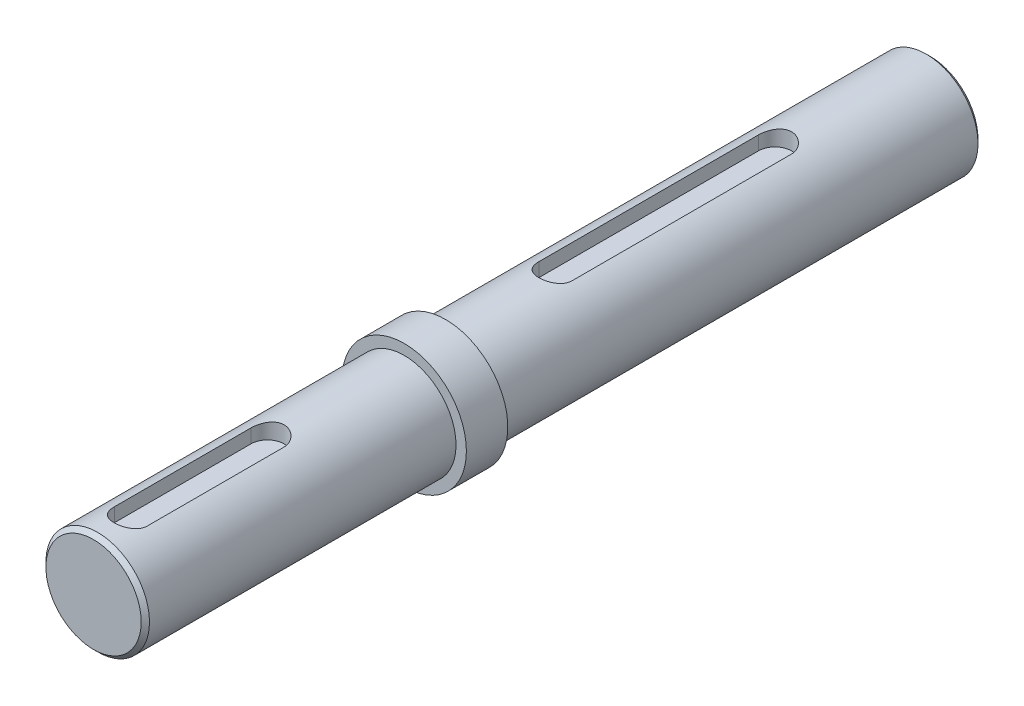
ISO-10303-21;
HEADER;
FILE_DESCRIPTION(('STEP AP214'),'2;1');
FILE_NAME('part.step','',(''),(''),'','','');
FILE_SCHEMA(('AUTOMOTIVE_DESIGN { 1 0 10303 214 1 1 1 1 }'));
ENDSEC;
DATA;
#1=APPLICATION_CONTEXT('core data for automotive mechanical design processes');
#2=APPLICATION_PROTOCOL_DEFINITION('international standard','automotive_design',2000,#1);
#3=PRODUCT_CONTEXT('',#1,'mechanical');
#4=PRODUCT('Part','Part','',(#3));
#5=PRODUCT_RELATED_PRODUCT_CATEGORY('part','',(#4));
#6=PRODUCT_DEFINITION_FORMATION('','',#4);
#7=PRODUCT_DEFINITION_CONTEXT('part definition',#1,'design');
#8=PRODUCT_DEFINITION('design','',#6,#7);
#9=PRODUCT_DEFINITION_SHAPE('','',#8);
#10=(LENGTH_UNIT() NAMED_UNIT(*) SI_UNIT(.MILLI.,.METRE.));
#11=(NAMED_UNIT(*) PLANE_ANGLE_UNIT() SI_UNIT($,.RADIAN.));
#12=(NAMED_UNIT(*) SI_UNIT($,.STERADIAN.) SOLID_ANGLE_UNIT());
#13=UNCERTAINTY_MEASURE_WITH_UNIT(LENGTH_MEASURE(1.E-05),#10,'distance_accuracy_value','');
#14=(GEOMETRIC_REPRESENTATION_CONTEXT(3) GLOBAL_UNCERTAINTY_ASSIGNED_CONTEXT((#13)) GLOBAL_UNIT_ASSIGNED_CONTEXT((#10,
#11,#12)) REPRESENTATION_CONTEXT('',''));
#15=CARTESIAN_POINT('',(0.,0.,0.));
#16=DIRECTION('',(0.,0.,1.));
#17=DIRECTION('',(1.,0.,0.));
#18=AXIS2_PLACEMENT_3D('',#15,#16,#17);
#19=CARTESIAN_POINT('',(0.,0.,202.));
#20=DIRECTION('',(0.,0.,-1.));
#21=DIRECTION('',(-1.,0.,0.));
#22=AXIS2_PLACEMENT_3D('',#19,#20,#21);
#23=CYLINDRICAL_SURFACE('',#22,15.);
#24=CARTESIAN_POINT('',(0.,0.,127.));
#25=DIRECTION('',(0.,0.,1.));
#26=DIRECTION('',(1.,0.,0.));
#27=AXIS2_PLACEMENT_3D('',#24,#25,#26);
#28=CIRCLE('',#27,15.);
#29=CARTESIAN_POINT('',(15.,0.,127.));
#30=VERTEX_POINT('',#29);
#31=EDGE_CURVE('E199',#30,#30,#28,.T.);
#32=ORIENTED_EDGE('',*,*,#31,.F.);
#33=EDGE_LOOP('',(#32));
#34=FACE_BOUND('',#33,.T.);
#35=CARTESIAN_POINT('',(0.,0.,117.));
#36=DIRECTION('',(0.,0.,-1.));
#37=DIRECTION('',(-1.,0.,0.));
#38=AXIS2_PLACEMENT_3D('',#35,#36,#37);
#39=CIRCLE('',#38,15.);
#40=CARTESIAN_POINT('',(-15.,0.,117.));
#41=VERTEX_POINT('',#40);
#42=EDGE_CURVE('E194',#41,#41,#39,.T.);
#43=ORIENTED_EDGE('',*,*,#42,.F.);
#44=EDGE_LOOP('',(#43));
#45=FACE_BOUND('',#44,.T.);
#46=ADVANCED_FACE('F44',(#34,#45),#23,.T.);
#47=CARTESIAN_POINT('',(0.,0.,127.));
#48=DIRECTION('',(0.,0.,1.));
#49=DIRECTION('',(1.,0.,0.));
#50=AXIS2_PLACEMENT_3D('',#47,#48,#49);
#51=PLANE('',#50);
#52=CARTESIAN_POINT('',(0.,0.,127.));
#53=DIRECTION('',(0.,0.,1.));
#54=DIRECTION('',(1.,0.,0.));
#55=AXIS2_PLACEMENT_3D('',#52,#53,#54);
#56=CIRCLE('',#55,12.5);
#57=CARTESIAN_POINT('',(12.5,0.,127.));
#58=VERTEX_POINT('',#57);
#59=EDGE_CURVE('E195',#58,#58,#56,.T.);
#60=ORIENTED_EDGE('',*,*,#59,.F.);
#61=EDGE_LOOP('',(#60));
#62=FACE_BOUND('',#61,.T.);
#63=ORIENTED_EDGE('',*,*,#31,.T.);
#64=EDGE_LOOP('',(#63));
#65=FACE_BOUND('',#64,.T.);
#66=ADVANCED_FACE('F308',(#62,#65),#51,.T.);
#67=CARTESIAN_POINT('',(0.,0.,127.));
#68=DIRECTION('',(0.,0.,1.));
#69=DIRECTION('',(1.,0.,0.));
#70=AXIS2_PLACEMENT_3D('',#67,#68,#69);
#71=CYLINDRICAL_SURFACE('',#70,12.5);
#72=CARTESIAN_POINT('',(0.,0.,201.));
#73=DIRECTION('',(0.,0.,1.));
#74=DIRECTION('',(1.,0.,0.));
#75=AXIS2_PLACEMENT_3D('',#72,#73,#74);
#76=CIRCLE('',#75,12.5);
#77=CARTESIAN_POINT('',(12.5,0.,201.));
#78=VERTEX_POINT('',#77);
#79=EDGE_CURVE('E12',#78,#78,#76,.F.);
#80=ORIENTED_EDGE('',*,*,#79,.T.);
#81=EDGE_LOOP('',(#80));
#82=FACE_BOUND('',#81,.T.);
#83=CARTESIAN_POINT('',(4.,11.842719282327,160.));
#84=CARTESIAN_POINT('',(4.00001410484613,11.8427027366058,159.890600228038));
#85=CARTESIAN_POINT('',(3.995512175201,11.8442348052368,159.781209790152));
#86=CARTESIAN_POINT('',(3.97758606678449,11.8502730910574,159.563271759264));
#87=CARTESIAN_POINT('',(3.96416412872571,11.8547785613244,159.454723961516));
#88=CARTESIAN_POINT('',(3.9285572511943,11.8666242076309,159.239538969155));
#89=CARTESIAN_POINT('',(3.9063967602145,11.8739564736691,159.132897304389));
#90=CARTESIAN_POINT('',(3.85353581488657,11.8912164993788,158.921994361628));
#91=CARTESIAN_POINT('',(3.82283508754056,11.90114434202,158.817733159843));
#92=CARTESIAN_POINT('',(3.71831764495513,11.9343840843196,158.509694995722));
#93=CARTESIAN_POINT('',(3.63203544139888,11.9611699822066,158.310363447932));
#94=CARTESIAN_POINT('',(3.42895021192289,12.0209583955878,157.928987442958));
#95=CARTESIAN_POINT('',(3.31213030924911,12.0539643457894,157.74695262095));
#96=CARTESIAN_POINT('',(3.04678507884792,12.123798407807,157.398746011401));
#97=CARTESIAN_POINT('',(2.89735303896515,12.1607158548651,157.233281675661));
#98=CARTESIAN_POINT('',(2.57296449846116,12.2334561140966,156.929285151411));
#99=CARTESIAN_POINT('',(2.39800356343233,12.2692787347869,156.790757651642));
#100=CARTESIAN_POINT('',(2.02237003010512,12.3368244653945,156.541384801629));
#101=CARTESIAN_POINT('',(1.82118394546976,12.3684294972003,156.43127804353));
#102=CARTESIAN_POINT('',(1.40197197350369,12.4229251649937,156.246750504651));
#103=CARTESIAN_POINT('',(1.18395091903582,12.4458182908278,156.172319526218));
#104=CARTESIAN_POINT('',(0.744713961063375,12.4796767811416,156.063641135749));
#105=CARTESIAN_POINT('',(0.523827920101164,12.4910030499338,156.02817506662));
#106=CARTESIAN_POINT('',(0.0789648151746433,12.5017287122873,155.994567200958));
#107=CARTESIAN_POINT('',(-0.145011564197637,12.5011307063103,155.996417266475));
#108=CARTESIAN_POINT('',(-0.581094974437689,12.4883236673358,156.036598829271));
#109=CARTESIAN_POINT('',(-0.793338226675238,12.4765355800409,156.073607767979));
#110=CARTESIAN_POINT('',(-1.2084232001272,12.443194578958,156.180880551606));
#111=CARTESIAN_POINT('',(-1.41126440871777,12.4216411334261,156.251146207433));
#112=CARTESIAN_POINT('',(-1.80478548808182,12.3706364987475,156.423757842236));
#113=CARTESIAN_POINT('',(-1.99528012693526,12.3410893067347,156.526496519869));
#114=CARTESIAN_POINT('',(-2.35673113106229,12.2771965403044,156.760829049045));
#115=CARTESIAN_POINT('',(-2.5276825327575,12.2428497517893,156.892430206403));
#116=CARTESIAN_POINT('',(-2.8530451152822,12.1712409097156,157.187446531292));
#117=CARTESIAN_POINT('',(-3.00641313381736,12.1339170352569,157.351996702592));
#118=CARTESIAN_POINT('',(-3.283772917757,12.0618172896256,157.704971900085));
#119=CARTESIAN_POINT('',(-3.40775562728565,12.0270422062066,157.893404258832));
#120=CARTESIAN_POINT('',(-3.56958208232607,11.9796198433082,158.191371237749));
#121=CARTESIAN_POINT('',(-3.61975674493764,11.9645161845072,158.293999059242));
#122=CARTESIAN_POINT('',(-3.71123075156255,11.9364591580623,158.503404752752));
#123=CARTESIAN_POINT('',(-3.75253376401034,11.9235049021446,158.610180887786));
#124=CARTESIAN_POINT('',(-3.82585831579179,11.9001802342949,158.827013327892));
#125=CARTESIAN_POINT('',(-3.85788979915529,11.889807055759,158.937065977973));
#126=CARTESIAN_POINT('',(-3.91241790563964,11.8719756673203,159.159695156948));
#127=CARTESIAN_POINT('',(-3.93491889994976,11.8645161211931,159.272270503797));
#128=CARTESIAN_POINT('',(-3.96832908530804,11.8533815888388,159.487239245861));
#129=CARTESIAN_POINT('',(-3.9802038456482,11.8493925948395,159.589467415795));
#130=CARTESIAN_POINT('',(-3.99603937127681,11.8440568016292,159.794461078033));
#131=CARTESIAN_POINT('',(-4.00001099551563,11.8427063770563,159.897225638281));
#132=CARTESIAN_POINT('',(-4.,11.842719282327,160.));
#133=B_SPLINE_CURVE_WITH_KNOTS('',3,(#83,#84,#85,#86,#87,#88,#89,#90,#91,#92,#93,#94,#95,#96,
#97,#98,#99,#100,#101,#102,#103,#104,#105,#106,#107,#108,#109,#110,#111,#112,#113,#114,#115,
#116,#117,#118,#119,#120,#121,#122,#123,#124,#125,#126,#127,#128,#129,#130,#131,#132),
.UNSPECIFIED.,.F.,.F.,(4,2,2,2,2,2,2,2,2,2,2,2,2,2,2,2,2,2,2,2,2,2,2,2,4),(0.,0.328080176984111,
0.656077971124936,0.983164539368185,1.31026156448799,1.96355293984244,2.61720612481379,
3.29209427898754,3.96709980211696,4.65819584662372,5.34909422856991,6.01770820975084,
6.68617638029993,7.33045501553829,7.97476873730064,8.62719320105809,9.27978300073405,
9.96076419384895,10.6419549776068,10.9872862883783,11.3324745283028,11.6772911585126,
12.0219494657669,12.3305938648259,12.6388138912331),.UNSPECIFIED.);
#134=CARTESIAN_POINT('',(4.,11.842719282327,160.));
#135=VERTEX_POINT('',#134);
#136=CARTESIAN_POINT('',(-4.,11.842719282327,160.));
#137=VERTEX_POINT('',#136);
#138=EDGE_CURVE('E202',#135,#137,#133,.T.);
#139=ORIENTED_EDGE('',*,*,#138,.F.);
#140=DIRECTION('',(0.,0.,1.));
#141=VECTOR('',#140,1.);
#142=CARTESIAN_POINT('',(4.,11.842719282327,127.));
#143=LINE('',#142,#141);
#144=CARTESIAN_POINT('',(4.,11.842719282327,193.));
#145=VERTEX_POINT('',#144);
#146=EDGE_CURVE('E245',#145,#135,#143,.F.);
#147=ORIENTED_EDGE('',*,*,#146,.F.);
#148=CARTESIAN_POINT('',(-4.,11.842719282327,193.));
#149=CARTESIAN_POINT('',(-4.00001410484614,11.8427027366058,193.109399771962));
#150=CARTESIAN_POINT('',(-3.995512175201,11.8442348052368,193.218790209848));
#151=CARTESIAN_POINT('',(-3.97758606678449,11.8502730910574,193.436728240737));
#152=CARTESIAN_POINT('',(-3.96416412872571,11.8547785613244,193.545276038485));
#153=CARTESIAN_POINT('',(-3.92855725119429,11.8666242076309,193.760461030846));
#154=CARTESIAN_POINT('',(-3.90639676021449,11.8739564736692,193.867102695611));
#155=CARTESIAN_POINT('',(-3.85353581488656,11.8912164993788,194.078005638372));
#156=CARTESIAN_POINT('',(-3.82283508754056,11.90114434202,194.182266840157));
#157=CARTESIAN_POINT('',(-3.71831764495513,11.9343840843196,194.490305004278));
#158=CARTESIAN_POINT('',(-3.63203544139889,11.9611699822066,194.689636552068));
#159=CARTESIAN_POINT('',(-3.42895021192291,12.0209583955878,195.071012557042));
#160=CARTESIAN_POINT('',(-3.31213030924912,12.0539643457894,195.25304737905));
#161=CARTESIAN_POINT('',(-3.04678507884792,12.123798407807,195.601253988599));
#162=CARTESIAN_POINT('',(-2.89735303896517,12.1607158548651,195.766718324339));
#163=CARTESIAN_POINT('',(-2.57296449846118,12.2334561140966,196.070714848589));
#164=CARTESIAN_POINT('',(-2.39800356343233,12.2692787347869,196.209242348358));
#165=CARTESIAN_POINT('',(-2.02237003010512,12.3368244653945,196.458615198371));
#166=CARTESIAN_POINT('',(-1.82118394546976,12.3684294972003,196.56872195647));
#167=CARTESIAN_POINT('',(-1.40197197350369,12.4229251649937,196.753249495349));
#168=CARTESIAN_POINT('',(-1.18395091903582,12.4458182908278,196.827680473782));
#169=CARTESIAN_POINT('',(-0.744713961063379,12.4796767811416,196.936358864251));
#170=CARTESIAN_POINT('',(-0.523827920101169,12.4910030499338,196.97182493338));
#171=CARTESIAN_POINT('',(-0.0789648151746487,12.5017287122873,197.005432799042));
#172=CARTESIAN_POINT('',(0.145011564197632,12.5011307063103,197.003582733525));
#173=CARTESIAN_POINT('',(0.581094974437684,12.4883236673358,196.963401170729));
#174=CARTESIAN_POINT('',(0.793338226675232,12.4765355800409,196.926392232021));
#175=CARTESIAN_POINT('',(1.2084232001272,12.443194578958,196.819119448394));
#176=CARTESIAN_POINT('',(1.41126440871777,12.4216411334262,196.748853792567));
#177=CARTESIAN_POINT('',(1.80478548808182,12.3706364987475,196.576242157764));
#178=CARTESIAN_POINT('',(1.99528012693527,12.3410893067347,196.473503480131));
#179=CARTESIAN_POINT('',(2.35673113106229,12.2771965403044,196.239170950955));
#180=CARTESIAN_POINT('',(2.5276825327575,12.2428497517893,196.107569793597));
#181=CARTESIAN_POINT('',(2.8530451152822,12.1712409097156,195.812553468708));
#182=CARTESIAN_POINT('',(3.00641313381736,12.1339170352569,195.648003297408));
#183=CARTESIAN_POINT('',(3.283772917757,12.0618172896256,195.295028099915));
#184=CARTESIAN_POINT('',(3.40775562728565,12.0270422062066,195.106595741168));
#185=CARTESIAN_POINT('',(3.56958208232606,11.9796198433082,194.808628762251));
#186=CARTESIAN_POINT('',(3.61975674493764,11.9645161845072,194.706000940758));
#187=CARTESIAN_POINT('',(3.71123075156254,11.9364591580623,194.496595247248));
#188=CARTESIAN_POINT('',(3.75253376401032,11.9235049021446,194.389819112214));
#189=CARTESIAN_POINT('',(3.82585831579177,11.9001802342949,194.172986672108));
#190=CARTESIAN_POINT('',(3.85788979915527,11.889807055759,194.062934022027));
#191=CARTESIAN_POINT('',(3.91241790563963,11.8719756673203,193.840304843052));
#192=CARTESIAN_POINT('',(3.93491889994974,11.8645161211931,193.727729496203));
#193=CARTESIAN_POINT('',(3.96832908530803,11.8533815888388,193.512760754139));
#194=CARTESIAN_POINT('',(3.98020384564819,11.8493925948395,193.410532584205));
#195=CARTESIAN_POINT('',(3.9960393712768,11.8440568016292,193.205538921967));
#196=CARTESIAN_POINT('',(4.00001099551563,11.8427063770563,193.102774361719));
#197=CARTESIAN_POINT('',(4.,11.842719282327,193.));
#198=B_SPLINE_CURVE_WITH_KNOTS('',3,(#148,#149,#150,#151,#152,#153,#154,#155,#156,#157,#158,
#159,#160,#161,#162,#163,#164,#165,#166,#167,#168,#169,#170,#171,#172,#173,#174,#175,#176,#177,
#178,#179,#180,#181,#182,#183,#184,#185,#186,#187,#188,#189,#190,#191,#192,#193,#194,#195,#196,
#197),.UNSPECIFIED.,.F.,.F.,(4,2,2,2,2,2,2,2,2,2,2,2,2,2,2,2,2,2,2,2,2,2,2,2,4),(0.,
0.328080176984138,0.656077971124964,0.98316453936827,1.31026156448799,1.96355293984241,
2.61720612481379,3.29209427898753,3.96709980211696,4.65819584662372,5.34909422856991,
6.01770820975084,6.68617638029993,7.33045501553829,7.97476873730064,8.62719320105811,
9.27978300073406,9.96076419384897,10.6419549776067,10.9872862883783,11.3324745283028,
11.6772911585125,12.0219494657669,12.3305938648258,12.6388138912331),.UNSPECIFIED.);
#199=CARTESIAN_POINT('',(-4.,11.842719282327,193.));
#200=VERTEX_POINT('',#199);
#201=EDGE_CURVE('E239',#200,#145,#198,.T.);
#202=ORIENTED_EDGE('',*,*,#201,.F.);
#203=DIRECTION('',(0.,0.,1.));
#204=VECTOR('',#203,1.);
#205=CARTESIAN_POINT('',(-4.,11.842719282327,127.));
#206=LINE('',#205,#204);
#207=EDGE_CURVE('E213',#137,#200,#206,.T.);
#208=ORIENTED_EDGE('',*,*,#207,.F.);
#209=EDGE_LOOP('',(#139,#147,#202,#208));
#210=FACE_BOUND('',#209,.T.);
#211=ORIENTED_EDGE('',*,*,#59,.T.);
#212=EDGE_LOOP('',(#211));
#213=FACE_BOUND('',#212,.T.);
#214=ADVANCED_FACE('F215',(#82,#210,#213),#71,.T.);
#215=CARTESIAN_POINT('',(0.,0.,202.));
#216=DIRECTION('',(0.,0.,1.));
#217=DIRECTION('',(1.,0.,0.));
#218=AXIS2_PLACEMENT_3D('',#215,#216,#217);
#219=PLANE('',#218);
#220=CARTESIAN_POINT('',(0.,0.,202.));
#221=DIRECTION('',(0.,0.,1.));
#222=DIRECTION('',(1.,0.,0.));
#223=AXIS2_PLACEMENT_3D('',#220,#221,#222);
#224=CIRCLE('',#223,11.5);
#225=CARTESIAN_POINT('',(11.5,0.,202.));
#226=VERTEX_POINT('',#225);
#227=EDGE_CURVE('E52',#226,#226,#224,.T.);
#228=ORIENTED_EDGE('',*,*,#227,.T.);
#229=EDGE_LOOP('',(#228));
#230=FACE_BOUND('',#229,.T.);
#231=ADVANCED_FACE('F292',(#230),#219,.T.);
#232=CARTESIAN_POINT('',(0.,0.,117.));
#233=DIRECTION('',(0.,0.,-1.));
#234=DIRECTION('',(-1.,0.,0.));
#235=AXIS2_PLACEMENT_3D('',#232,#233,#234);
#236=PLANE('',#235);
#237=CARTESIAN_POINT('',(0.,0.,117.));
#238=DIRECTION('',(0.,0.,-1.));
#239=DIRECTION('',(-1.,0.,0.));
#240=AXIS2_PLACEMENT_3D('',#237,#238,#239);
#241=CIRCLE('',#240,12.5);
#242=CARTESIAN_POINT('',(-12.5,0.,117.));
#243=VERTEX_POINT('',#242);
#244=EDGE_CURVE('E180',#243,#243,#241,.T.);
#245=ORIENTED_EDGE('',*,*,#244,.F.);
#246=EDGE_LOOP('',(#245));
#247=FACE_BOUND('',#246,.T.);
#248=ORIENTED_EDGE('',*,*,#42,.T.);
#249=EDGE_LOOP('',(#248));
#250=FACE_BOUND('',#249,.T.);
#251=ADVANCED_FACE('F318',(#247,#250),#236,.T.);
#252=CARTESIAN_POINT('',(0.,0.,117.));
#253=DIRECTION('',(0.,0.,-1.));
#254=DIRECTION('',(-1.,0.,0.));
#255=AXIS2_PLACEMENT_3D('',#252,#253,#254);
#256=CYLINDRICAL_SURFACE('',#255,12.5);
#257=CARTESIAN_POINT('',(0.,0.,1.));
#258=DIRECTION('',(0.,0.,1.));
#259=DIRECTION('',(1.,0.,0.));
#260=AXIS2_PLACEMENT_3D('',#257,#258,#259);
#261=CIRCLE('',#260,12.5);
#262=CARTESIAN_POINT('',(12.5,0.,1.));
#263=VERTEX_POINT('',#262);
#264=EDGE_CURVE('E285',#263,#263,#261,.T.);
#265=ORIENTED_EDGE('',*,*,#264,.T.);
#266=EDGE_LOOP('',(#265));
#267=FACE_BOUND('',#266,.T.);
#268=CARTESIAN_POINT('',(-3.99999999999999,11.842719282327,90.5));
#269=CARTESIAN_POINT('',(-4.00001410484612,11.8427027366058,90.6093997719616));
#270=CARTESIAN_POINT('',(-3.99551217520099,11.8442348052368,90.7187902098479));
#271=CARTESIAN_POINT('',(-3.97758606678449,11.8502730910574,90.9367282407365));
#272=CARTESIAN_POINT('',(-3.9641641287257,11.8547785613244,91.0452760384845));
#273=CARTESIAN_POINT('',(-3.92855725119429,11.8666242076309,91.2604610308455));
#274=CARTESIAN_POINT('',(-3.90639676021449,11.8739564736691,91.3671026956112));
#275=CARTESIAN_POINT('',(-3.85353581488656,11.8912164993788,91.5780056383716));
#276=CARTESIAN_POINT('',(-3.82283508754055,11.90114434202,91.6822668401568));
#277=CARTESIAN_POINT('',(-3.71831764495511,11.9343840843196,91.9903050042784));
#278=CARTESIAN_POINT('',(-3.63203544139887,11.9611699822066,92.189636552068));
#279=CARTESIAN_POINT('',(-3.42895021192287,12.0209583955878,92.5710125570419));
#280=CARTESIAN_POINT('',(-3.31213030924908,12.0539643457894,92.7530473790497));
#281=CARTESIAN_POINT('',(-3.04678507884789,12.123798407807,93.1012539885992));
#282=CARTESIAN_POINT('',(-2.89735303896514,12.1607158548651,93.2667183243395));
#283=CARTESIAN_POINT('',(-2.57296449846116,12.2334561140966,93.5707148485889));
#284=CARTESIAN_POINT('',(-2.39800356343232,12.2692787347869,93.7092423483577));
#285=CARTESIAN_POINT('',(-2.02237003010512,12.3368244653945,93.9586151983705));
#286=CARTESIAN_POINT('',(-1.82118394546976,12.3684294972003,94.0687219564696));
#287=CARTESIAN_POINT('',(-1.40197197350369,12.4229251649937,94.2532494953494));
#288=CARTESIAN_POINT('',(-1.18395091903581,12.4458182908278,94.3276804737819));
#289=CARTESIAN_POINT('',(-0.744713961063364,12.4796767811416,94.4363588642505));
#290=CARTESIAN_POINT('',(-0.523827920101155,12.4910030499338,94.4718249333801));
#291=CARTESIAN_POINT('',(-0.0789648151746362,12.5017287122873,94.5054327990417));
#292=CARTESIAN_POINT('',(0.145011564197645,12.5011307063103,94.5035827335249));
#293=CARTESIAN_POINT('',(0.581094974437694,12.4883236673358,94.4634011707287));
#294=CARTESIAN_POINT('',(0.793338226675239,12.4765355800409,94.4263922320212));
#295=CARTESIAN_POINT('',(1.20842320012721,12.443194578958,94.3191194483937));
#296=CARTESIAN_POINT('',(1.41126440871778,12.4216411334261,94.2488537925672));
#297=CARTESIAN_POINT('',(1.80478548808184,12.3706364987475,94.0762421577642));
#298=CARTESIAN_POINT('',(1.99528012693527,12.3410893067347,93.9735034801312));
#299=CARTESIAN_POINT('',(2.35673113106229,12.2771965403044,93.7391709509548));
#300=CARTESIAN_POINT('',(2.52768253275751,12.2428497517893,93.607569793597));
#301=CARTESIAN_POINT('',(2.85304511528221,12.1712409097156,93.3125534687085));
#302=CARTESIAN_POINT('',(3.00641313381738,12.1339170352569,93.1480032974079));
#303=CARTESIAN_POINT('',(3.28377291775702,12.0618172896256,92.7950280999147));
#304=CARTESIAN_POINT('',(3.40775562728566,12.0270422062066,92.6065957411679));
#305=CARTESIAN_POINT('',(3.56958208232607,11.9796198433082,92.3086287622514));
#306=CARTESIAN_POINT('',(3.61975674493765,11.9645161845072,92.2060009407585));
#307=CARTESIAN_POINT('',(3.71123075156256,11.9364591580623,91.9965952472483));
#308=CARTESIAN_POINT('',(3.75253376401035,11.9235049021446,91.8898191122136));
#309=CARTESIAN_POINT('',(3.82585831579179,11.9001802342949,91.6729866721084));
#310=CARTESIAN_POINT('',(3.85788979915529,11.889807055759,91.5629340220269));
#311=CARTESIAN_POINT('',(3.91241790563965,11.8719756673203,91.3403048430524));
#312=CARTESIAN_POINT('',(3.93491889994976,11.8645161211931,91.2277294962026));
#313=CARTESIAN_POINT('',(3.96832908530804,11.8533815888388,91.012760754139));
#314=CARTESIAN_POINT('',(3.98020384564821,11.8493925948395,90.9105325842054));
#315=CARTESIAN_POINT('',(3.99603937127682,11.8440568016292,90.7055389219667));
#316=CARTESIAN_POINT('',(4.00001099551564,11.8427063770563,90.6027743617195));
#317=CARTESIAN_POINT('',(4.00000000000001,11.842719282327,90.5));
#318=B_SPLINE_CURVE_WITH_KNOTS('',3,(#268,#269,#270,#271,#272,#273,#274,#275,#276,#277,#278,
#279,#280,#281,#282,#283,#284,#285,#286,#287,#288,#289,#290,#291,#292,#293,#294,#295,#296,#297,
#298,#299,#300,#301,#302,#303,#304,#305,#306,#307,#308,#309,#310,#311,#312,#313,#314,#315,#316,
#317),.UNSPECIFIED.,.F.,.F.,(4,2,2,2,2,2,2,2,2,2,2,2,2,2,2,2,2,2,2,2,2,2,2,2,4),(0.,
0.328080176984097,0.656077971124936,0.983164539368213,1.31026156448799,1.96355293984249,
2.61720612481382,3.29209427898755,3.96709980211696,4.65819584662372,5.34909422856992,
6.01770820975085,6.68617638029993,7.3304550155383,7.97476873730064,8.62719320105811,
9.27978300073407,9.96076419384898,10.6419549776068,10.9872862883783,11.3324745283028,
11.6772911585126,12.0219494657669,12.3305938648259,12.6388138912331),.UNSPECIFIED.);
#319=CARTESIAN_POINT('',(-3.99999999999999,11.842719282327,90.5));
#320=VERTEX_POINT('',#319);
#321=CARTESIAN_POINT('',(4.00000000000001,11.842719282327,90.5));
#322=VERTEX_POINT('',#321);
#323=EDGE_CURVE('E248',#320,#322,#318,.T.);
#324=ORIENTED_EDGE('',*,*,#323,.F.);
#325=DIRECTION('',(0.,0.,-1.));
#326=VECTOR('',#325,1.);
#327=CARTESIAN_POINT('',(-3.99999999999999,11.842719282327,117.));
#328=LINE('',#327,#326);
#329=CARTESIAN_POINT('',(-3.99999999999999,11.842719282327,37.5));
#330=VERTEX_POINT('',#329);
#331=EDGE_CURVE('E279',#330,#320,#328,.F.);
#332=ORIENTED_EDGE('',*,*,#331,.F.);
#333=CARTESIAN_POINT('',(4.00000000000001,11.842719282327,37.5));
#334=CARTESIAN_POINT('',(4.00001410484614,11.8427027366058,37.3906002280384));
#335=CARTESIAN_POINT('',(3.995512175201,11.8442348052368,37.2812097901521));
#336=CARTESIAN_POINT('',(3.9775860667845,11.8502730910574,37.0632717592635));
#337=CARTESIAN_POINT('',(3.96416412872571,11.8547785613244,36.9547239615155));
#338=CARTESIAN_POINT('',(3.9285572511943,11.8666242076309,36.7395389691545));
#339=CARTESIAN_POINT('',(3.90639676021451,11.8739564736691,36.6328973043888));
#340=CARTESIAN_POINT('',(3.85353581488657,11.8912164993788,36.4219943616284));
#341=CARTESIAN_POINT('',(3.82283508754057,11.90114434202,36.3177331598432));
#342=CARTESIAN_POINT('',(3.71831764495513,11.9343840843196,36.0096949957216));
#343=CARTESIAN_POINT('',(3.63203544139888,11.9611699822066,35.810363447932));
#344=CARTESIAN_POINT('',(3.42895021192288,12.0209583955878,35.4289874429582));
#345=CARTESIAN_POINT('',(3.3121303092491,12.0539643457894,35.2469526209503));
#346=CARTESIAN_POINT('',(3.0467850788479,12.123798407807,34.8987460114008));
#347=CARTESIAN_POINT('',(2.89735303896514,12.1607158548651,34.7332816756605));
#348=CARTESIAN_POINT('',(2.57296449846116,12.2334561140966,34.4292851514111));
#349=CARTESIAN_POINT('',(2.39800356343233,12.2692787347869,34.2907576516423));
#350=CARTESIAN_POINT('',(2.02237003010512,12.3368244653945,34.0413848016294));
#351=CARTESIAN_POINT('',(1.82118394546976,12.3684294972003,33.9312780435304));
#352=CARTESIAN_POINT('',(1.40197197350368,12.4229251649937,33.7467505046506));
#353=CARTESIAN_POINT('',(1.18395091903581,12.4458182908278,33.6723195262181));
#354=CARTESIAN_POINT('',(0.744713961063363,12.4796767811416,33.5636411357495));
#355=CARTESIAN_POINT('',(0.523827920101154,12.4910030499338,33.5281750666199));
#356=CARTESIAN_POINT('',(0.0789648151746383,12.5017287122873,33.4945672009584));
#357=CARTESIAN_POINT('',(-0.14501156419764,12.5011307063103,33.4964172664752));
#358=CARTESIAN_POINT('',(-0.581094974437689,12.4883236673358,33.5365988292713));
#359=CARTESIAN_POINT('',(-0.793338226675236,12.4765355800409,33.5736077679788));
#360=CARTESIAN_POINT('',(-1.2084232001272,12.443194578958,33.6808805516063));
#361=CARTESIAN_POINT('',(-1.41126440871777,12.4216411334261,33.7511462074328));
#362=CARTESIAN_POINT('',(-1.80478548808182,12.3706364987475,33.9237578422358));
#363=CARTESIAN_POINT('',(-1.99528012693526,12.3410893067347,34.0264965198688));
#364=CARTESIAN_POINT('',(-2.35673113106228,12.2771965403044,34.2608290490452));
#365=CARTESIAN_POINT('',(-2.5276825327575,12.2428497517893,34.392430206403));
#366=CARTESIAN_POINT('',(-2.8530451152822,12.1712409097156,34.6874465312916));
#367=CARTESIAN_POINT('',(-3.00641313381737,12.1339170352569,34.8519967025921));
#368=CARTESIAN_POINT('',(-3.28377291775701,12.0618172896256,35.2049719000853));
#369=CARTESIAN_POINT('',(-3.40775562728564,12.0270422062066,35.3934042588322));
#370=CARTESIAN_POINT('',(-3.56958208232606,11.9796198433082,35.6913712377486));
#371=CARTESIAN_POINT('',(-3.61975674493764,11.9645161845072,35.7939990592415));
#372=CARTESIAN_POINT('',(-3.71123075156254,11.9364591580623,36.0034047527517));
#373=CARTESIAN_POINT('',(-3.75253376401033,11.9235049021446,36.1101808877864));
#374=CARTESIAN_POINT('',(-3.82585831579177,11.9001802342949,36.3270133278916));
#375=CARTESIAN_POINT('',(-3.85788979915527,11.889807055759,36.4370659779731));
#376=CARTESIAN_POINT('',(-3.91241790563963,11.8719756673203,36.6596951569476));
#377=CARTESIAN_POINT('',(-3.93491889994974,11.8645161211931,36.7722705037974));
#378=CARTESIAN_POINT('',(-3.96832908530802,11.8533815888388,36.987239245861));
#379=CARTESIAN_POINT('',(-3.98020384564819,11.8493925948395,37.0894674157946));
#380=CARTESIAN_POINT('',(-3.99603937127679,11.8440568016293,37.2944610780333));
#381=CARTESIAN_POINT('',(-4.00001099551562,11.8427063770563,37.3972256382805));
#382=CARTESIAN_POINT('',(-3.99999999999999,11.842719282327,37.5));
#383=B_SPLINE_CURVE_WITH_KNOTS('',3,(#333,#334,#335,#336,#337,#338,#339,#340,#341,#342,#343,
#344,#345,#346,#347,#348,#349,#350,#351,#352,#353,#354,#355,#356,#357,#358,#359,#360,#361,#362,
#363,#364,#365,#366,#367,#368,#369,#370,#371,#372,#373,#374,#375,#376,#377,#378,#379,#380,#381,
#382),.UNSPECIFIED.,.F.,.F.,(4,2,2,2,2,2,2,2,2,2,2,2,2,2,2,2,2,2,2,2,2,2,2,2,4),(0.,
0.328080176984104,0.656077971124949,0.983164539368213,1.310261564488,1.96355293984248,
2.61720612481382,3.29209427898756,3.96709980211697,4.65819584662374,5.34909422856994,
6.01770820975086,6.68617638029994,7.3304550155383,7.97476873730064,8.6271932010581,
9.27978300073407,9.96076419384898,10.6419549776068,10.9872862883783,11.3324745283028,
11.6772911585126,12.0219494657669,12.3305938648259,12.6388138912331),.UNSPECIFIED.);
#384=CARTESIAN_POINT('',(4.00000000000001,11.842719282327,37.5));
#385=VERTEX_POINT('',#384);
#386=EDGE_CURVE('E273',#385,#330,#383,.T.);
#387=ORIENTED_EDGE('',*,*,#386,.F.);
#388=DIRECTION('',(0.,0.,-1.));
#389=VECTOR('',#388,1.);
#390=CARTESIAN_POINT('',(4.00000000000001,11.842719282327,117.));
#391=LINE('',#390,#389);
#392=EDGE_CURVE('E255',#322,#385,#391,.T.);
#393=ORIENTED_EDGE('',*,*,#392,.F.);
#394=EDGE_LOOP('',(#324,#332,#387,#393));
#395=FACE_BOUND('',#394,.T.);
#396=ORIENTED_EDGE('',*,*,#244,.T.);
#397=EDGE_LOOP('',(#396));
#398=FACE_BOUND('',#397,.T.);
#399=ADVANCED_FACE('F237',(#267,#395,#398),#256,.T.);
#400=CARTESIAN_POINT('',(0.,0.,0.));
#401=DIRECTION('',(0.,0.,1.));
#402=DIRECTION('',(1.,0.,0.));
#403=AXIS2_PLACEMENT_3D('',#400,#401,#402);
#404=PLANE('',#403);
#405=CARTESIAN_POINT('',(0.,0.,0.));
#406=DIRECTION('',(0.,0.,-1.));
#407=DIRECTION('',(-1.,0.,0.));
#408=AXIS2_PLACEMENT_3D('',#405,#406,#407);
#409=CIRCLE('',#408,3.39999999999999);
#410=CARTESIAN_POINT('',(-3.39999999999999,0.,0.));
#411=VERTEX_POINT('',#410);
#412=EDGE_CURVE('E122',#411,#411,#409,.T.);
#413=ORIENTED_EDGE('',*,*,#412,.F.);
#414=EDGE_LOOP('',(#413));
#415=FACE_BOUND('',#414,.T.);
#416=CARTESIAN_POINT('',(0.,0.,0.));
#417=DIRECTION('',(0.,0.,1.));
#418=DIRECTION('',(1.,0.,0.));
#419=AXIS2_PLACEMENT_3D('',#416,#417,#418);
#420=CIRCLE('',#419,11.5);
#421=CARTESIAN_POINT('',(11.5,0.,0.));
#422=VERTEX_POINT('',#421);
#423=EDGE_CURVE('E281',#422,#422,#420,.F.);
#424=ORIENTED_EDGE('',*,*,#423,.T.);
#425=EDGE_LOOP('',(#424));
#426=FACE_BOUND('',#425,.T.);
#427=ADVANCED_FACE('F235',(#415,#426),#404,.F.);
#428=CARTESIAN_POINT('',(0.,8.5,193.));
#429=DIRECTION('',(0.,1.,0.));
#430=DIRECTION('',(-1.,0.,0.));
#431=AXIS2_PLACEMENT_3D('',#428,#429,#430);
#432=CYLINDRICAL_SURFACE('',#431,4.);
#433=DIRECTION('',(0.,1.,0.));
#434=VECTOR('',#433,1.);
#435=CARTESIAN_POINT('',(-4.,8.5,193.));
#436=LINE('',#435,#434);
#437=CARTESIAN_POINT('',(-4.,8.5,193.));
#438=VERTEX_POINT('',#437);
#439=EDGE_CURVE('E176',#438,#200,#436,.T.);
#440=ORIENTED_EDGE('',*,*,#439,.T.);
#441=ORIENTED_EDGE('',*,*,#201,.T.);
#442=DIRECTION('',(0.,1.,0.));
#443=VECTOR('',#442,1.);
#444=CARTESIAN_POINT('',(3.99999999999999,8.5,193.));
#445=LINE('',#444,#443);
#446=CARTESIAN_POINT('',(3.99999999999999,8.5,193.));
#447=VERTEX_POINT('',#446);
#448=EDGE_CURVE('E67',#447,#145,#445,.T.);
#449=ORIENTED_EDGE('',*,*,#448,.F.);
#450=CARTESIAN_POINT('',(0.,8.5,193.));
#451=DIRECTION('',(0.,1.,0.));
#452=DIRECTION('',(-1.,0.,0.));
#453=AXIS2_PLACEMENT_3D('',#450,#451,#452);
#454=CIRCLE('',#453,4.);
#455=EDGE_CURVE('E150',#438,#447,#454,.T.);
#456=ORIENTED_EDGE('',*,*,#455,.F.);
#457=EDGE_LOOP('',(#440,#441,#449,#456));
#458=FACE_BOUND('',#457,.T.);
#459=ADVANCED_FACE('F231',(#458),#432,.F.);
#460=CARTESIAN_POINT('',(-4.,8.5,160.));
#461=DIRECTION('',(-1.,0.,0.));
#462=DIRECTION('',(0.,-1.,0.));
#463=AXIS2_PLACEMENT_3D('',#460,#461,#462);
#464=PLANE('',#463);
#465=ORIENTED_EDGE('',*,*,#207,.T.);
#466=ORIENTED_EDGE('',*,*,#439,.F.);
#467=DIRECTION('',(0.,0.,1.));
#468=VECTOR('',#467,1.);
#469=CARTESIAN_POINT('',(-4.,8.5,160.));
#470=LINE('',#469,#468);
#471=CARTESIAN_POINT('',(-4.,8.5,160.));
#472=VERTEX_POINT('',#471);
#473=EDGE_CURVE('E172',#472,#438,#470,.T.);
#474=ORIENTED_EDGE('',*,*,#473,.F.);
#475=DIRECTION('',(0.,1.,0.));
#476=VECTOR('',#475,1.);
#477=CARTESIAN_POINT('',(-4.,8.5,160.));
#478=LINE('',#477,#476);
#479=EDGE_CURVE('E181',#472,#137,#478,.T.);
#480=ORIENTED_EDGE('',*,*,#479,.T.);
#481=EDGE_LOOP('',(#465,#466,#474,#480));
#482=FACE_BOUND('',#481,.T.);
#483=ADVANCED_FACE('F225',(#482),#464,.F.);
#484=CARTESIAN_POINT('',(0.,8.5,160.));
#485=DIRECTION('',(0.,1.,0.));
#486=DIRECTION('',(-1.,0.,0.));
#487=AXIS2_PLACEMENT_3D('',#484,#485,#486);
#488=CYLINDRICAL_SURFACE('',#487,4.);
#489=DIRECTION('',(0.,1.,0.));
#490=VECTOR('',#489,1.);
#491=CARTESIAN_POINT('',(4.,8.5,160.));
#492=LINE('',#491,#490);
#493=CARTESIAN_POINT('',(4.,8.5,160.));
#494=VERTEX_POINT('',#493);
#495=EDGE_CURVE('E185',#494,#135,#492,.T.);
#496=ORIENTED_EDGE('',*,*,#495,.T.);
#497=ORIENTED_EDGE('',*,*,#138,.T.);
#498=ORIENTED_EDGE('',*,*,#479,.F.);
#499=CARTESIAN_POINT('',(0.,8.5,160.));
#500=DIRECTION('',(0.,1.,0.));
#501=DIRECTION('',(-1.,0.,0.));
#502=AXIS2_PLACEMENT_3D('',#499,#500,#501);
#503=CIRCLE('',#502,4.);
#504=EDGE_CURVE('E168',#494,#472,#503,.T.);
#505=ORIENTED_EDGE('',*,*,#504,.F.);
#506=EDGE_LOOP('',(#496,#497,#498,#505));
#507=FACE_BOUND('',#506,.T.);
#508=ADVANCED_FACE('F219',(#507),#488,.F.);
#509=CARTESIAN_POINT('',(3.99999999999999,8.5,193.));
#510=DIRECTION('',(1.,0.,0.));
#511=DIRECTION('',(0.,0.,-1.));
#512=AXIS2_PLACEMENT_3D('',#509,#510,#511);
#513=PLANE('',#512);
#514=ORIENTED_EDGE('',*,*,#146,.T.);
#515=ORIENTED_EDGE('',*,*,#495,.F.);
#516=DIRECTION('',(0.,0.,-1.));
#517=VECTOR('',#516,1.);
#518=CARTESIAN_POINT('',(3.99999999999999,8.5,193.));
#519=LINE('',#518,#517);
#520=EDGE_CURVE('E164',#447,#494,#519,.T.);
#521=ORIENTED_EDGE('',*,*,#520,.F.);
#522=ORIENTED_EDGE('',*,*,#448,.T.);
#523=EDGE_LOOP('',(#514,#515,#521,#522));
#524=FACE_BOUND('',#523,.T.);
#525=ADVANCED_FACE('F224',(#524),#513,.F.);
#526=CARTESIAN_POINT('',(0.,8.5,193.));
#527=DIRECTION('',(0.,1.,0.));
#528=DIRECTION('',(-1.,0.,0.));
#529=AXIS2_PLACEMENT_3D('',#526,#527,#528);
#530=PLANE('',#529);
#531=ORIENTED_EDGE('',*,*,#455,.T.);
#532=ORIENTED_EDGE('',*,*,#520,.T.);
#533=ORIENTED_EDGE('',*,*,#504,.T.);
#534=ORIENTED_EDGE('',*,*,#473,.T.);
#535=EDGE_LOOP('',(#531,#532,#533,#534));
#536=FACE_BOUND('',#535,.T.);
#537=ADVANCED_FACE('F230',(#536),#530,.T.);
#538=CARTESIAN_POINT('',(0.,8.5,37.5));
#539=DIRECTION('',(0.,1.,0.));
#540=DIRECTION('',(-1.,0.,0.));
#541=AXIS2_PLACEMENT_3D('',#538,#539,#540);
#542=CYLINDRICAL_SURFACE('',#541,4.);
#543=DIRECTION('',(0.,1.,0.));
#544=VECTOR('',#543,1.);
#545=CARTESIAN_POINT('',(4.00000000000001,8.5,37.5));
#546=LINE('',#545,#544);
#547=CARTESIAN_POINT('',(4.00000000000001,8.5,37.5));
#548=VERTEX_POINT('',#547);
#549=EDGE_CURVE('E146',#548,#385,#546,.T.);
#550=ORIENTED_EDGE('',*,*,#549,.T.);
#551=ORIENTED_EDGE('',*,*,#386,.T.);
#552=DIRECTION('',(0.,1.,0.));
#553=VECTOR('',#552,1.);
#554=CARTESIAN_POINT('',(-3.99999999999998,8.5,37.5));
#555=LINE('',#554,#553);
#556=CARTESIAN_POINT('',(-3.99999999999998,8.5,37.5));
#557=VERTEX_POINT('',#556);
#558=EDGE_CURVE('E59',#557,#330,#555,.T.);
#559=ORIENTED_EDGE('',*,*,#558,.F.);
#560=CARTESIAN_POINT('',(0.,8.5,37.5));
#561=DIRECTION('',(0.,1.,0.));
#562=DIRECTION('',(-1.,0.,0.));
#563=AXIS2_PLACEMENT_3D('',#560,#561,#562);
#564=CIRCLE('',#563,4.);
#565=EDGE_CURVE('E128',#548,#557,#564,.T.);
#566=ORIENTED_EDGE('',*,*,#565,.F.);
#567=EDGE_LOOP('',(#550,#551,#559,#566));
#568=FACE_BOUND('',#567,.T.);
#569=ADVANCED_FACE('F269',(#568),#542,.F.);
#570=CARTESIAN_POINT('',(4.00000000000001,8.5,90.5));
#571=DIRECTION('',(1.,0.,0.));
#572=DIRECTION('',(0.,1.,0.));
#573=AXIS2_PLACEMENT_3D('',#570,#571,#572);
#574=PLANE('',#573);
#575=ORIENTED_EDGE('',*,*,#392,.T.);
#576=ORIENTED_EDGE('',*,*,#549,.F.);
#577=DIRECTION('',(0.,0.,-1.));
#578=VECTOR('',#577,1.);
#579=CARTESIAN_POINT('',(4.00000000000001,8.5,90.5));
#580=LINE('',#579,#578);
#581=CARTESIAN_POINT('',(4.00000000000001,8.5,90.5));
#582=VERTEX_POINT('',#581);
#583=EDGE_CURVE('E142',#582,#548,#580,.T.);
#584=ORIENTED_EDGE('',*,*,#583,.F.);
#585=DIRECTION('',(0.,1.,0.));
#586=VECTOR('',#585,1.);
#587=CARTESIAN_POINT('',(4.00000000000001,8.5,90.5));
#588=LINE('',#587,#586);
#589=EDGE_CURVE('E151',#582,#322,#588,.T.);
#590=ORIENTED_EDGE('',*,*,#589,.T.);
#591=EDGE_LOOP('',(#575,#576,#584,#590));
#592=FACE_BOUND('',#591,.T.);
#593=ADVANCED_FACE('F263',(#592),#574,.F.);
#594=CARTESIAN_POINT('',(0.,8.5,90.5));
#595=DIRECTION('',(0.,1.,0.));
#596=DIRECTION('',(-1.,0.,0.));
#597=AXIS2_PLACEMENT_3D('',#594,#595,#596);
#598=CYLINDRICAL_SURFACE('',#597,4.);
#599=DIRECTION('',(0.,1.,0.));
#600=VECTOR('',#599,1.);
#601=CARTESIAN_POINT('',(-3.99999999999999,8.5,90.5));
#602=LINE('',#601,#600);
#603=CARTESIAN_POINT('',(-3.99999999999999,8.5,90.5));
#604=VERTEX_POINT('',#603);
#605=EDGE_CURVE('E155',#604,#320,#602,.T.);
#606=ORIENTED_EDGE('',*,*,#605,.T.);
#607=ORIENTED_EDGE('',*,*,#323,.T.);
#608=ORIENTED_EDGE('',*,*,#589,.F.);
#609=CARTESIAN_POINT('',(0.,8.5,90.5));
#610=DIRECTION('',(0.,1.,0.));
#611=DIRECTION('',(-1.,0.,0.));
#612=AXIS2_PLACEMENT_3D('',#609,#610,#611);
#613=CIRCLE('',#612,4.);
#614=EDGE_CURVE('E138',#604,#582,#613,.T.);
#615=ORIENTED_EDGE('',*,*,#614,.F.);
#616=EDGE_LOOP('',(#606,#607,#608,#615));
#617=FACE_BOUND('',#616,.T.);
#618=ADVANCED_FACE('F257',(#617),#598,.F.);
#619=CARTESIAN_POINT('',(-3.99999999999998,8.5,37.5));
#620=DIRECTION('',(-1.,0.,0.));
#621=DIRECTION('',(0.,0.,1.));
#622=AXIS2_PLACEMENT_3D('',#619,#620,#621);
#623=PLANE('',#622);
#624=ORIENTED_EDGE('',*,*,#331,.T.);
#625=ORIENTED_EDGE('',*,*,#605,.F.);
#626=DIRECTION('',(0.,0.,1.));
#627=VECTOR('',#626,1.);
#628=CARTESIAN_POINT('',(-3.99999999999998,8.5,37.5));
#629=LINE('',#628,#627);
#630=EDGE_CURVE('E134',#557,#604,#629,.T.);
#631=ORIENTED_EDGE('',*,*,#630,.F.);
#632=ORIENTED_EDGE('',*,*,#558,.T.);
#633=EDGE_LOOP('',(#624,#625,#631,#632));
#634=FACE_BOUND('',#633,.T.);
#635=ADVANCED_FACE('F262',(#634),#623,.F.);
#636=CARTESIAN_POINT('',(0.,8.5,37.5));
#637=DIRECTION('',(0.,1.,0.));
#638=DIRECTION('',(-1.,0.,0.));
#639=AXIS2_PLACEMENT_3D('',#636,#637,#638);
#640=PLANE('',#639);
#641=ORIENTED_EDGE('',*,*,#565,.T.);
#642=ORIENTED_EDGE('',*,*,#630,.T.);
#643=ORIENTED_EDGE('',*,*,#614,.T.);
#644=ORIENTED_EDGE('',*,*,#583,.T.);
#645=EDGE_LOOP('',(#641,#642,#643,#644));
#646=FACE_BOUND('',#645,.T.);
#647=ADVANCED_FACE('F268',(#646),#640,.T.);
#648=CARTESIAN_POINT('',(0.,0.,0.));
#649=DIRECTION('',(0.,0.,1.));
#650=DIRECTION('',(1.,0.,0.));
#651=AXIS2_PLACEMENT_3D('',#648,#649,#650);
#652=CONICAL_SURFACE('',#651,11.5,0.785398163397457);
#653=ORIENTED_EDGE('',*,*,#264,.F.);
#654=EDGE_LOOP('',(#653));
#655=FACE_BOUND('',#654,.T.);
#656=ORIENTED_EDGE('',*,*,#423,.F.);
#657=EDGE_LOOP('',(#656));
#658=FACE_BOUND('',#657,.T.);
#659=ADVANCED_FACE('F296',(#655,#658),#652,.T.);
#660=CARTESIAN_POINT('',(0.,0.,202.));
#661=DIRECTION('',(0.,0.,-1.));
#662=DIRECTION('',(-1.,0.,0.));
#663=AXIS2_PLACEMENT_3D('',#660,#661,#662);
#664=CONICAL_SURFACE('',#663,11.5,0.785398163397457);
#665=ORIENTED_EDGE('',*,*,#79,.F.);
#666=EDGE_LOOP('',(#665));
#667=FACE_BOUND('',#666,.T.);
#668=ORIENTED_EDGE('',*,*,#227,.F.);
#669=EDGE_LOOP('',(#668));
#670=FACE_BOUND('',#669,.T.);
#671=ADVANCED_FACE('F294',(#667,#670),#664,.T.);
#672=CARTESIAN_POINT('',(0.,0.,0.));
#673=DIRECTION('',(0.,0.,-1.));
#674=DIRECTION('',(-1.,0.,0.));
#675=AXIS2_PLACEMENT_3D('',#672,#673,#674);
#676=CYLINDRICAL_SURFACE('',#675,3.39999999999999);
#677=CARTESIAN_POINT('',(0.,0.,20.));
#678=DIRECTION('',(0.,0.,-1.));
#679=DIRECTION('',(-1.,0.,0.));
#680=AXIS2_PLACEMENT_3D('',#677,#678,#679);
#681=CIRCLE('',#680,3.39999999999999);
#682=CARTESIAN_POINT('',(-3.39999999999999,0.,20.));
#683=VERTEX_POINT('',#682);
#684=EDGE_CURVE('E119',#683,#683,#681,.T.);
#685=ORIENTED_EDGE('',*,*,#684,.F.);
#686=EDGE_LOOP('',(#685));
#687=FACE_BOUND('',#686,.T.);
#688=ORIENTED_EDGE('',*,*,#412,.T.);
#689=EDGE_LOOP('',(#688));
#690=FACE_BOUND('',#689,.T.);
#691=ADVANCED_FACE('F115',(#687,#690),#676,.F.);
#692=CARTESIAN_POINT('',(0.,0.,20.));
#693=DIRECTION('',(0.,0.,-1.));
#694=DIRECTION('',(-1.,0.,0.));
#695=AXIS2_PLACEMENT_3D('',#692,#693,#694);
#696=CONICAL_SURFACE('',#695,3.39999999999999,1.02974425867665);
#697=CARTESIAN_POINT('',(0.,0.,22.0429261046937));
#698=VERTEX_POINT('',#697);
#699=VERTEX_LOOP('',#698);
#700=FACE_BOUND('',#699,.T.);
#701=ORIENTED_EDGE('',*,*,#684,.T.);
#702=EDGE_LOOP('',(#701));
#703=FACE_BOUND('',#702,.T.);
#704=ADVANCED_FACE('F112',(#700,#703),#696,.F.);
#705=CLOSED_SHELL('',(#46,#66,#214,#231,#251,#399,#427,#459,#483,#508,#525,#537,#569,#593,#618,
#635,#647,#659,#671,#691,#704));
#706=MANIFOLD_SOLID_BREP('B2',#705);
#707=ADVANCED_BREP_SHAPE_REPRESENTATION('',(#18,#706),#14);
#708=SHAPE_DEFINITION_REPRESENTATION(#9,#707);
ENDSEC;
END-ISO-10303-21;
